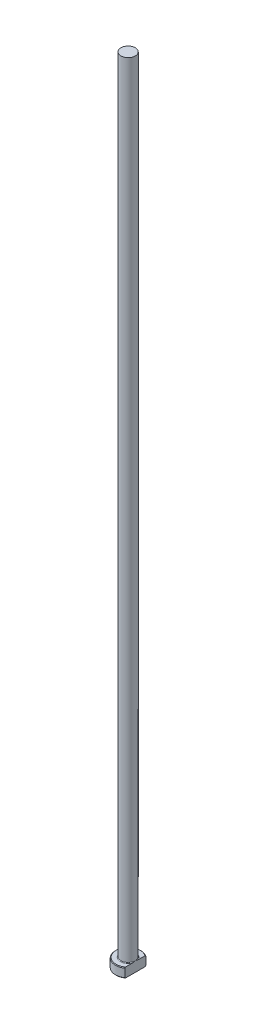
ISO-10303-21;
HEADER;
FILE_DESCRIPTION(('STEP AP214'),'2;1');
FILE_NAME('part.step','',(''),(''),'','','');
FILE_SCHEMA(('AUTOMOTIVE_DESIGN { 1 0 10303 214 1 1 1 1 }'));
ENDSEC;
DATA;
#1=APPLICATION_CONTEXT('core data for automotive mechanical design processes');
#2=APPLICATION_PROTOCOL_DEFINITION('international standard','automotive_design',2000,#1);
#3=PRODUCT_CONTEXT('',#1,'mechanical');
#4=PRODUCT('Part','Part','',(#3));
#5=PRODUCT_RELATED_PRODUCT_CATEGORY('part','',(#4));
#6=PRODUCT_DEFINITION_FORMATION('','',#4);
#7=PRODUCT_DEFINITION_CONTEXT('part definition',#1,'design');
#8=PRODUCT_DEFINITION('design','',#6,#7);
#9=PRODUCT_DEFINITION_SHAPE('','',#8);
#10=(LENGTH_UNIT() NAMED_UNIT(*) SI_UNIT(.MILLI.,.METRE.));
#11=(NAMED_UNIT(*) PLANE_ANGLE_UNIT() SI_UNIT($,.RADIAN.));
#12=(NAMED_UNIT(*) SI_UNIT($,.STERADIAN.) SOLID_ANGLE_UNIT());
#13=UNCERTAINTY_MEASURE_WITH_UNIT(LENGTH_MEASURE(1.E-05),#10,'distance_accuracy_value','');
#14=(GEOMETRIC_REPRESENTATION_CONTEXT(3) GLOBAL_UNCERTAINTY_ASSIGNED_CONTEXT((#13)) GLOBAL_UNIT_ASSIGNED_CONTEXT((#10,
#11,#12)) REPRESENTATION_CONTEXT('',''));
#15=CARTESIAN_POINT('',(0.,0.,0.));
#16=DIRECTION('',(0.,0.,1.));
#17=DIRECTION('',(1.,0.,0.));
#18=AXIS2_PLACEMENT_3D('',#15,#16,#17);
#19=CARTESIAN_POINT('',(0.,0.,0.));
#20=DIRECTION('',(0.,-1.,0.));
#21=DIRECTION('',(0.,0.,-1.));
#22=AXIS2_PLACEMENT_3D('',#19,#20,#21);
#23=PLANE('',#22);
#24=CARTESIAN_POINT('',(0.,0.,0.));
#25=DIRECTION('',(0.,-1.,0.));
#26=DIRECTION('',(0.,0.,-1.));
#27=AXIS2_PLACEMENT_3D('',#24,#25,#26);
#28=CIRCLE('',#27,3.79999999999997);
#29=CARTESIAN_POINT('',(2.24999999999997,0.,3.0622703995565));
#30=VERTEX_POINT('',#29);
#31=CARTESIAN_POINT('',(2.24999999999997,0.,-3.0622703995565));
#32=VERTEX_POINT('',#31);
#33=EDGE_CURVE('E98',#30,#32,#28,.T.);
#34=ORIENTED_EDGE('',*,*,#33,.T.);
#35=DIRECTION('',(0.,0.,1.));
#36=VECTOR('',#35,1.);
#37=CARTESIAN_POINT('',(2.24999999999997,0.,-3.30718913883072));
#38=LINE('',#37,#36);
#39=EDGE_CURVE('E83',#32,#30,#38,.T.);
#40=ORIENTED_EDGE('',*,*,#39,.T.);
#41=EDGE_LOOP('',(#34,#40));
#42=FACE_BOUND('',#41,.T.);
#43=ADVANCED_FACE('F32',(#42),#23,.T.);
#44=CARTESIAN_POINT('',(0.,259.958771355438,0.));
#45=DIRECTION('',(0.,1.,0.));
#46=DIRECTION('',(0.,0.,1.));
#47=AXIS2_PLACEMENT_3D('',#44,#45,#46);
#48=CYLINDRICAL_SURFACE('',#47,3.99999999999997);
#49=CARTESIAN_POINT('',(0.,2.80000000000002,0.));
#50=DIRECTION('',(0.,1.,0.));
#51=DIRECTION('',(0.,0.,1.));
#52=AXIS2_PLACEMENT_3D('',#49,#50,#51);
#53=CIRCLE('',#52,3.99999999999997);
#54=CARTESIAN_POINT('',(2.24999999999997,2.80000000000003,3.30718913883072));
#55=VERTEX_POINT('',#54);
#56=CARTESIAN_POINT('',(2.24999999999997,2.80000000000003,-3.30718913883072));
#57=VERTEX_POINT('',#56);
#58=EDGE_CURVE('E104',#55,#57,#53,.F.);
#59=ORIENTED_EDGE('',*,*,#58,.T.);
#60=DIRECTION('',(0.,-1.,0.));
#61=VECTOR('',#60,1.);
#62=CARTESIAN_POINT('',(2.24999999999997,250.,-3.30718913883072));
#63=LINE('',#62,#61);
#64=CARTESIAN_POINT('',(2.24999999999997,0.200000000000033,-3.30718913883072));
#65=VERTEX_POINT('',#64);
#66=EDGE_CURVE('E183',#57,#65,#63,.T.);
#67=ORIENTED_EDGE('',*,*,#66,.T.);
#68=CARTESIAN_POINT('',(0.,0.200000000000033,0.));
#69=DIRECTION('',(0.,-1.,0.));
#70=DIRECTION('',(0.,0.,-1.));
#71=AXIS2_PLACEMENT_3D('',#68,#69,#70);
#72=CIRCLE('',#71,3.99999999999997);
#73=CARTESIAN_POINT('',(2.24999999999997,0.200000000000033,3.30718913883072));
#74=VERTEX_POINT('',#73);
#75=EDGE_CURVE('E100',#65,#74,#72,.F.);
#76=ORIENTED_EDGE('',*,*,#75,.T.);
#77=DIRECTION('',(0.,-1.,0.));
#78=VECTOR('',#77,1.);
#79=CARTESIAN_POINT('',(2.24999999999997,250.,3.30718913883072));
#80=LINE('',#79,#78);
#81=EDGE_CURVE('E93',#55,#74,#80,.T.);
#82=ORIENTED_EDGE('',*,*,#81,.F.);
#83=EDGE_LOOP('',(#59,#67,#76,#82));
#84=FACE_BOUND('',#83,.T.);
#85=ADVANCED_FACE('F158',(#84),#48,.T.);
#86=CARTESIAN_POINT('',(-3.99999999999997,3.,0.));
#87=DIRECTION('',(0.,1.,0.));
#88=DIRECTION('',(0.,0.,1.));
#89=AXIS2_PLACEMENT_3D('',#86,#87,#88);
#90=PLANE('',#89);
#91=CARTESIAN_POINT('',(0.,3.,0.));
#92=DIRECTION('',(0.,1.,0.));
#93=DIRECTION('',(0.,0.,1.));
#94=AXIS2_PLACEMENT_3D('',#91,#92,#93);
#95=CIRCLE('',#94,3.8);
#96=CARTESIAN_POINT('',(2.24999999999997,3.,-3.06227039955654));
#97=VERTEX_POINT('',#96);
#98=CARTESIAN_POINT('',(2.24999999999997,3.,3.06227039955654));
#99=VERTEX_POINT('',#98);
#100=EDGE_CURVE('E178',#97,#99,#95,.T.);
#101=ORIENTED_EDGE('',*,*,#100,.T.);
#102=DIRECTION('',(0.,0.,-1.));
#103=VECTOR('',#102,1.);
#104=CARTESIAN_POINT('',(2.24999999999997,3.,0.));
#105=LINE('',#104,#103);
#106=CARTESIAN_POINT('',(2.24999999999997,2.99999999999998,0.969535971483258));
#107=VERTEX_POINT('',#106);
#108=EDGE_CURVE('E57',#99,#107,#105,.T.);
#109=ORIENTED_EDGE('',*,*,#108,.T.);
#110=CARTESIAN_POINT('',(0.,3.,0.));
#111=DIRECTION('',(0.,1.,0.));
#112=DIRECTION('',(0.,0.,1.));
#113=AXIS2_PLACEMENT_3D('',#110,#111,#112);
#114=CIRCLE('',#113,2.44999999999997);
#115=CARTESIAN_POINT('',(2.24999999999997,2.99999999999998,-0.969535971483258));
#116=VERTEX_POINT('',#115);
#117=EDGE_CURVE('E107',#107,#116,#114,.F.);
#118=ORIENTED_EDGE('',*,*,#117,.T.);
#119=EDGE_CURVE('E136',#116,#97,#105,.T.);
#120=ORIENTED_EDGE('',*,*,#119,.T.);
#121=EDGE_LOOP('',(#101,#109,#118,#120));
#122=FACE_BOUND('',#121,.T.);
#123=ADVANCED_FACE('F147',(#122),#90,.T.);
#124=CARTESIAN_POINT('',(0.,3.,0.));
#125=DIRECTION('',(0.,-1.,0.));
#126=DIRECTION('',(0.,0.,-1.));
#127=AXIS2_PLACEMENT_3D('',#124,#125,#126);
#128=CONICAL_SURFACE('',#127,3.8,0.785398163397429);
#129=ORIENTED_EDGE('',*,*,#58,.F.);
#130=CARTESIAN_POINT('',(2.24999999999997,-0.817697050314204,7.27782992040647));
#131=CARTESIAN_POINT('',(2.24999999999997,-0.691332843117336,7.14556140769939));
#132=CARTESIAN_POINT('',(2.24999999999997,-0.565122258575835,7.01314597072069));
#133=CARTESIAN_POINT('',(2.24999999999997,-0.313071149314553,6.74796170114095));
#134=CARTESIAN_POINT('',(2.24999999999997,-0.187230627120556,6.61519286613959));
#135=CARTESIAN_POINT('',(2.24999999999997,0.189705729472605,6.21619905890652));
#136=CARTESIAN_POINT('',(2.24999999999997,0.44014920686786,5.94935693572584));
#137=CARTESIAN_POINT('',(2.24999999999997,0.940260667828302,5.41146981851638));
#138=CARTESIAN_POINT('',(2.24999999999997,1.18991116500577,5.14040850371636));
#139=CARTESIAN_POINT('',(2.24999999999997,1.56140055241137,4.7311368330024));
#140=CARTESIAN_POINT('',(2.24999999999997,1.68472451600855,4.59427552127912));
#141=CARTESIAN_POINT('',(2.24999999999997,1.93009407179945,4.31941326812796));
#142=CARTESIAN_POINT('',(2.24999999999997,2.05213967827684,4.18141233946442));
#143=CARTESIAN_POINT('',(2.24999999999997,2.31419582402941,3.88150807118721));
#144=CARTESIAN_POINT('',(2.24999999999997,2.45391708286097,3.71935099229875));
#145=CARTESIAN_POINT('',(2.24999999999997,2.73025215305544,3.39234412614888));
#146=CARTESIAN_POINT('',(2.24999999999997,2.86686529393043,3.22749377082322));
#147=CARTESIAN_POINT('',(2.24999999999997,3.13534139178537,2.8943084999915));
#148=CARTESIAN_POINT('',(2.24999999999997,3.26721073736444,2.72597879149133));
#149=CARTESIAN_POINT('',(2.24999999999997,3.45966785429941,2.46950762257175));
#150=CARTESIAN_POINT('',(2.24999999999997,3.52291962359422,2.3833682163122));
#151=CARTESIAN_POINT('',(2.24999999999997,3.64714184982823,2.20946418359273));
#152=CARTESIAN_POINT('',(2.24999999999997,3.70811252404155,2.12169971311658));
#153=CARTESIAN_POINT('',(2.24999999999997,3.82102230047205,1.95327886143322));
#154=CARTESIAN_POINT('',(2.24999999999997,3.87324695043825,1.87281476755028));
#155=CARTESIAN_POINT('',(2.24999999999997,3.97467249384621,1.70998172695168));
#156=CARTESIAN_POINT('',(2.24999999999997,4.02387305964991,1.62761257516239));
#157=CARTESIAN_POINT('',(2.24999999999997,4.11837607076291,1.46059799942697));
#158=CARTESIAN_POINT('',(2.24999999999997,4.16367708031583,1.3759517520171));
#159=CARTESIAN_POINT('',(2.24999999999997,4.24914050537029,1.20413766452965));
#160=CARTESIAN_POINT('',(2.24999999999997,4.28930406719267,1.11697039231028));
#161=CARTESIAN_POINT('',(2.24999999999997,4.38314726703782,0.891175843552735));
#162=CARTESIAN_POINT('',(2.24999999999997,4.4321974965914,0.750488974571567));
#163=CARTESIAN_POINT('',(2.24999999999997,4.48826674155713,0.535159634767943));
#164=CARTESIAN_POINT('',(2.24999999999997,4.50402844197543,0.462776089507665));
#165=CARTESIAN_POINT('',(2.24999999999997,4.52893388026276,0.316860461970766));
#166=CARTESIAN_POINT('',(2.24999999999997,4.53807847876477,0.243328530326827));
#167=CARTESIAN_POINT('',(2.24999999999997,4.5492247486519,0.094950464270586));
#168=CARTESIAN_POINT('',(2.24999999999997,4.55115152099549,0.0200986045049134));
#169=CARTESIAN_POINT('',(2.24999999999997,4.54752076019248,-0.129420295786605));
#170=CARTESIAN_POINT('',(2.24999999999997,4.54196316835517,-0.204087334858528));
#171=CARTESIAN_POINT('',(2.24999999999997,4.52372329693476,-0.352688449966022));
#172=CARTESIAN_POINT('',(2.24999999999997,4.51102617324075,-0.426620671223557));
#173=CARTESIAN_POINT('',(2.24999999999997,4.47926333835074,-0.573094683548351));
#174=CARTESIAN_POINT('',(2.24999999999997,4.46019612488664,-0.645636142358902));
#175=CARTESIAN_POINT('',(2.24999999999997,4.40610994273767,-0.823701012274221));
#176=CARTESIAN_POINT('',(2.24999999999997,4.3678344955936,-0.928230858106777));
#177=CARTESIAN_POINT('',(2.24999999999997,4.28232692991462,-1.13354070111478));
#178=CARTESIAN_POINT('',(2.24999999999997,4.23508812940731,-1.23431783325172));
#179=CARTESIAN_POINT('',(2.24999999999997,4.13380125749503,-1.43298762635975));
#180=CARTESIAN_POINT('',(2.24999999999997,4.07972026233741,-1.53086330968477));
#181=CARTESIAN_POINT('',(2.24999999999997,3.99496203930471,-1.67548648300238));
#182=CARTESIAN_POINT('',(2.24999999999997,3.96610811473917,-1.72332162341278));
#183=CARTESIAN_POINT('',(2.24999999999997,3.90734436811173,-1.81833709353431));
#184=CARTESIAN_POINT('',(2.24999999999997,3.87743458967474,-1.8655174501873));
#185=CARTESIAN_POINT('',(2.24999999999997,3.77509597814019,-2.02354622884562));
#186=CARTESIAN_POINT('',(2.24999999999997,3.70057106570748,-2.13303820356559));
#187=CARTESIAN_POINT('',(2.24999999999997,3.54784662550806,-2.34943854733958));
#188=CARTESIAN_POINT('',(2.24999999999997,3.46964624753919,-2.45634630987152));
#189=CARTESIAN_POINT('',(2.24999999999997,3.31046802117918,-2.66818697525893));
#190=CARTESIAN_POINT('',(2.24999999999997,3.22948822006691,-2.77311840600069));
#191=CARTESIAN_POINT('',(2.24999999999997,3.06545223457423,-2.98134898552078));
#192=CARTESIAN_POINT('',(2.24999999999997,2.98239592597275,-3.08464803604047));
#193=CARTESIAN_POINT('',(2.24999999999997,2.73044258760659,-3.39308007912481));
#194=CARTESIAN_POINT('',(2.24999999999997,2.55914389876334,-3.59624854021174));
#195=CARTESIAN_POINT('',(2.24999999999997,2.21260420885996,-3.9990152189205));
#196=CARTESIAN_POINT('',(2.24999999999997,2.03736490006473,-4.19861490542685));
#197=CARTESIAN_POINT('',(2.24999999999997,1.68403823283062,-4.59551245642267));
#198=CARTESIAN_POINT('',(2.24999999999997,1.50594904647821,-4.79280869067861));
#199=CARTESIAN_POINT('',(2.24999999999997,1.14782580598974,-5.18566037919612));
#200=CARTESIAN_POINT('',(2.24999999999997,0.967791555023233,-5.38121565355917));
#201=CARTESIAN_POINT('',(2.24999999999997,0.606519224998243,-5.77078870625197));
#202=CARTESIAN_POINT('',(2.24999999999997,0.425282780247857,-5.96480800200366));
#203=CARTESIAN_POINT('',(2.24999999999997,0.0617463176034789,-6.35184762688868));
#204=CARTESIAN_POINT('',(2.24999999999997,-0.120553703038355,-6.54486795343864));
#205=CARTESIAN_POINT('',(2.24999999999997,-0.388876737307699,-6.82775668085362));
#206=CARTESIAN_POINT('',(2.24999999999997,-0.474578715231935,-6.91792994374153));
#207=CARTESIAN_POINT('',(2.24999999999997,-0.646062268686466,-7.09803491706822));
#208=CARTESIAN_POINT('',(2.24999999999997,-0.731843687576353,-7.18796677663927));
#209=CARTESIAN_POINT('',(2.24999999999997,-0.817697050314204,-7.27782992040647));
#210=B_SPLINE_CURVE_WITH_KNOTS('',3,(#130,#131,#132,#133,#134,#135,#136,#137,#138,#139,#140,
#141,#142,#143,#144,#145,#146,#147,#148,#149,#150,#151,#152,#153,#154,#155,#156,#157,#158,#159,
#160,#161,#162,#163,#164,#165,#166,#167,#168,#169,#170,#171,#172,#173,#174,#175,#176,#177,#178,
#179,#180,#181,#182,#183,#184,#185,#186,#187,#188,#189,#190,#191,#192,#193,#194,#195,#196,#197,
#198,#199,#200,#201,#202,#203,#204,#205,#206,#207,#208,#209),.UNSPECIFIED.,.F.,.F.,(4,2,2,2,2,2,
2,2,2,2,2,2,2,2,2,2,2,2,2,2,2,2,2,2,2,2,2,2,2,2,2,2,2,2,2,2,2,2,2,4),(0.,0.548785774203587,
1.09757528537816,2.19544562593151,3.30094607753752,3.85362276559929,4.40629327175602,
5.04841012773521,5.69066421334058,6.33201824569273,6.65259523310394,6.97314160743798,
7.26086761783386,7.54862474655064,7.83648737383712,8.12428565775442,8.56956070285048,
8.79154735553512,9.01350513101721,9.23775987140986,9.46201637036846,9.68674086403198,
9.91151839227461,10.2448678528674,10.5784668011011,10.9137368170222,11.0813178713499,
11.2488920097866,11.6461164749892,12.0434332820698,12.4410351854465,12.8386609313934,
13.6357991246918,14.43260129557,15.2299368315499,16.0273538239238,16.8238479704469,
17.6203441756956,17.9935523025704,18.3664002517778),.UNSPECIFIED.);
#211=EDGE_CURVE('E135',#55,#99,#210,.T.);
#212=ORIENTED_EDGE('',*,*,#211,.T.);
#213=ORIENTED_EDGE('',*,*,#100,.F.);
#214=EDGE_CURVE('E127',#97,#57,#210,.T.);
#215=ORIENTED_EDGE('',*,*,#214,.T.);
#216=EDGE_LOOP('',(#129,#212,#213,#215));
#217=FACE_BOUND('',#216,.T.);
#218=ADVANCED_FACE('F143',(#217),#128,.T.);
#219=CARTESIAN_POINT('',(0.,0.200000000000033,0.));
#220=DIRECTION('',(0.,1.,0.));
#221=DIRECTION('',(0.,0.,1.));
#222=AXIS2_PLACEMENT_3D('',#219,#220,#221);
#223=CONICAL_SURFACE('',#222,3.99999999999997,0.785398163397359);
#224=ORIENTED_EDGE('',*,*,#75,.F.);
#225=CARTESIAN_POINT('',(2.24999999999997,3.81769705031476,-7.27782992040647));
#226=CARTESIAN_POINT('',(2.24999999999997,3.69133284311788,-7.14556140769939));
#227=CARTESIAN_POINT('',(2.24999999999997,3.56512225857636,-7.01314597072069));
#228=CARTESIAN_POINT('',(2.24999999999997,3.31307114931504,-6.74796170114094));
#229=CARTESIAN_POINT('',(2.24999999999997,3.18723062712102,-6.61519286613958));
#230=CARTESIAN_POINT('',(2.24999999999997,2.8102942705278,-6.21619905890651));
#231=CARTESIAN_POINT('',(2.24999999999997,2.55985079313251,-5.94935693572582));
#232=CARTESIAN_POINT('',(2.24999999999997,2.05973933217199,-5.41146981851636));
#233=CARTESIAN_POINT('',(2.24999999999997,1.81008883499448,-5.14040850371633));
#234=CARTESIAN_POINT('',(2.24999999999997,1.43859944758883,-4.73113683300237));
#235=CARTESIAN_POINT('',(2.24999999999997,1.31527548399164,-4.59427552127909));
#236=CARTESIAN_POINT('',(2.24999999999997,1.0699059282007,-4.31941326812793));
#237=CARTESIAN_POINT('',(2.24999999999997,0.94786032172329,-4.18141233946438));
#238=CARTESIAN_POINT('',(2.24999999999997,0.685804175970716,-3.88150807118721));
#239=CARTESIAN_POINT('',(2.24999999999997,0.546082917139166,-3.71935099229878));
#240=CARTESIAN_POINT('',(2.24999999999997,0.269747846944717,-3.39234412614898));
#241=CARTESIAN_POINT('',(2.24999999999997,0.133134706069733,-3.22749377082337));
#242=CARTESIAN_POINT('',(2.24999999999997,-0.135341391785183,-2.89430849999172));
#243=CARTESIAN_POINT('',(2.24999999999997,-0.267210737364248,-2.72597879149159));
#244=CARTESIAN_POINT('',(2.24999999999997,-0.459667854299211,-2.46950762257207));
#245=CARTESIAN_POINT('',(2.24999999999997,-0.522919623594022,-2.38336821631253));
#246=CARTESIAN_POINT('',(2.24999999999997,-0.647141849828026,-2.20946418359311));
#247=CARTESIAN_POINT('',(2.24999999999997,-0.708112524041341,-2.12169971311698));
#248=CARTESIAN_POINT('',(2.24999999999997,-0.821022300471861,-1.95327886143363));
#249=CARTESIAN_POINT('',(2.24999999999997,-0.873246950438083,-1.87281476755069));
#250=CARTESIAN_POINT('',(2.24999999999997,-0.974672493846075,-1.70998172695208));
#251=CARTESIAN_POINT('',(2.24999999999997,-1.02387305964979,-1.62761257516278));
#252=CARTESIAN_POINT('',(2.24999999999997,-1.11837607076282,-1.46059799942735));
#253=CARTESIAN_POINT('',(2.24999999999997,-1.16367708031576,-1.37595175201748));
#254=CARTESIAN_POINT('',(2.24999999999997,-1.24914050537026,-1.20413766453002));
#255=CARTESIAN_POINT('',(2.24999999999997,-1.28930406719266,-1.11697039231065));
#256=CARTESIAN_POINT('',(2.24999999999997,-1.38314726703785,-0.891175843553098));
#257=CARTESIAN_POINT('',(2.24999999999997,-1.43219749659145,-0.750488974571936));
#258=CARTESIAN_POINT('',(2.24999999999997,-1.48826674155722,-0.535159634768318));
#259=CARTESIAN_POINT('',(2.24999999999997,-1.50402844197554,-0.462776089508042));
#260=CARTESIAN_POINT('',(2.24999999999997,-1.52893388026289,-0.316860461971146));
#261=CARTESIAN_POINT('',(2.24999999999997,-1.53807847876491,-0.243328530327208));
#262=CARTESIAN_POINT('',(2.24999999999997,-1.54922474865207,-0.0949504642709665));
#263=CARTESIAN_POINT('',(2.24999999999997,-1.55115152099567,-0.0200986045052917));
#264=CARTESIAN_POINT('',(2.24999999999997,-1.54752076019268,0.129420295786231));
#265=CARTESIAN_POINT('',(2.24999999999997,-1.54196316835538,0.204087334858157));
#266=CARTESIAN_POINT('',(2.24999999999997,-1.523723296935,0.352688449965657));
#267=CARTESIAN_POINT('',(2.24999999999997,-1.511026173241,0.426620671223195));
#268=CARTESIAN_POINT('',(2.24999999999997,-1.47926333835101,0.573094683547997));
#269=CARTESIAN_POINT('',(2.24999999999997,-1.46019612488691,0.645636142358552));
#270=CARTESIAN_POINT('',(2.24999999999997,-1.40610994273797,0.823701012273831));
#271=CARTESIAN_POINT('',(2.24999999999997,-1.36783449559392,0.928230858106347));
#272=CARTESIAN_POINT('',(2.24999999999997,-1.282326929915,1.13354070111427));
#273=CARTESIAN_POINT('',(2.24999999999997,-1.23508812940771,1.23431783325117));
#274=CARTESIAN_POINT('',(2.24999999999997,-1.13380125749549,1.43298762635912));
#275=CARTESIAN_POINT('',(2.24999999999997,-1.0797202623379,1.53086330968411));
#276=CARTESIAN_POINT('',(2.24999999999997,-0.994962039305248,1.67548648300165));
#277=CARTESIAN_POINT('',(2.24999999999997,-0.966108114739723,1.72332162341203));
#278=CARTESIAN_POINT('',(2.24999999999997,-0.907344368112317,1.81833709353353));
#279=CARTESIAN_POINT('',(2.24999999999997,-0.877434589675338,1.86551745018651));
#280=CARTESIAN_POINT('',(2.24999999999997,-0.775095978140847,2.02354622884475));
#281=CARTESIAN_POINT('',(2.24999999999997,-0.700571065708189,2.13303820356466));
#282=CARTESIAN_POINT('',(2.24999999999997,-0.547846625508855,2.34943854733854));
#283=CARTESIAN_POINT('',(2.24999999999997,-0.469646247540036,2.45634630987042));
#284=CARTESIAN_POINT('',(2.24999999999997,-0.310468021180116,2.66818697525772));
#285=CARTESIAN_POINT('',(2.24999999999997,-0.229488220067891,2.77311840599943));
#286=CARTESIAN_POINT('',(2.24999999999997,-0.065452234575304,2.98134898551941));
#287=CARTESIAN_POINT('',(2.24999999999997,0.0176040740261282,3.08464803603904));
#288=CARTESIAN_POINT('',(2.24999999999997,0.269557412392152,3.39308007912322));
#289=CARTESIAN_POINT('',(2.24999999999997,0.440856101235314,3.59624854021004));
#290=CARTESIAN_POINT('',(2.24999999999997,0.787395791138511,3.99901521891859));
#291=CARTESIAN_POINT('',(2.24999999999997,0.962635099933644,4.19861490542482));
#292=CARTESIAN_POINT('',(2.24999999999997,1.31596176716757,4.59551245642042));
#293=CARTESIAN_POINT('',(2.24999999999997,1.49405095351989,4.79280869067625));
#294=CARTESIAN_POINT('',(2.24999999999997,1.85217419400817,5.18566037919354));
#295=CARTESIAN_POINT('',(2.24999999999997,2.0322084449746,5.38121565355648));
#296=CARTESIAN_POINT('',(2.24999999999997,2.39348077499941,5.77078870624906));
#297=CARTESIAN_POINT('',(2.24999999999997,2.5747172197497,5.96480800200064));
#298=CARTESIAN_POINT('',(2.24999999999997,2.9382536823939,6.35184762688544));
#299=CARTESIAN_POINT('',(2.24999999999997,3.12055370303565,6.54486795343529));
#300=CARTESIAN_POINT('',(2.24999999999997,3.38887673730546,6.82775668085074));
#301=CARTESIAN_POINT('',(2.24999999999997,3.47457871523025,6.91792994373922));
#302=CARTESIAN_POINT('',(2.24999999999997,3.6460622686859,7.09803491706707));
#303=CARTESIAN_POINT('',(2.24999999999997,3.73184368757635,7.1879667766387));
#304=CARTESIAN_POINT('',(2.24999999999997,3.81769705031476,7.27782992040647));
#305=B_SPLINE_CURVE_WITH_KNOTS('',3,(#225,#226,#227,#228,#229,#230,#231,#232,#233,#234,#235,
#236,#237,#238,#239,#240,#241,#242,#243,#244,#245,#246,#247,#248,#249,#250,#251,#252,#253,#254,
#255,#256,#257,#258,#259,#260,#261,#262,#263,#264,#265,#266,#267,#268,#269,#270,#271,#272,#273,
#274,#275,#276,#277,#278,#279,#280,#281,#282,#283,#284,#285,#286,#287,#288,#289,#290,#291,#292,
#293,#294,#295,#296,#297,#298,#299,#300,#301,#302,#303,#304),.UNSPECIFIED.,.F.,.F.,(4,2,2,2,2,2,
2,2,2,2,2,2,2,2,2,2,2,2,2,2,2,2,2,2,2,2,2,2,2,2,2,2,2,2,2,2,2,2,2,4),(0.,0.548785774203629,
1.09757528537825,2.19544562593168,3.30094607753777,3.85362276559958,4.40629327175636,
5.04841012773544,5.69066421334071,6.33201824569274,6.65259523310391,6.97314160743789,
7.26086761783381,7.54862474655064,7.83648737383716,8.12428565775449,8.56956070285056,
8.7915473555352,9.01350513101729,9.23775987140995,9.46201637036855,9.68674086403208,
9.91151839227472,10.2448678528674,10.5784668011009,10.9137368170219,11.0813178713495,
11.2488920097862,11.6461164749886,12.0434332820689,12.4410351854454,12.838660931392,
13.63579912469,14.4326012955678,15.2299368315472,16.0273538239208,16.8238479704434,
17.6203441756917,17.9935523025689,18.3664002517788),.UNSPECIFIED.);
#306=EDGE_CURVE('E86',#65,#32,#305,.T.);
#307=ORIENTED_EDGE('',*,*,#306,.T.);
#308=ORIENTED_EDGE('',*,*,#33,.F.);
#309=EDGE_CURVE('E89',#30,#74,#305,.T.);
#310=ORIENTED_EDGE('',*,*,#309,.T.);
#311=EDGE_LOOP('',(#224,#307,#308,#310));
#312=FACE_BOUND('',#311,.T.);
#313=ADVANCED_FACE('F97',(#312),#223,.T.);
#314=CARTESIAN_POINT('',(0.,3.19999999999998,0.));
#315=DIRECTION('',(0.,1.,0.));
#316=DIRECTION('',(0.,0.,1.));
#317=AXIS2_PLACEMENT_3D('',#314,#315,#316);
#318=TOROIDAL_SURFACE('',#317,2.44999999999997,0.2);
#319=CARTESIAN_POINT('',(2.24999999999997,3.19999999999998,0.));
#320=CARTESIAN_POINT('',(2.24999999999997,3.20000050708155,6.44726104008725E-11));
#321=CARTESIAN_POINT('',(2.24999999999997,3.20000101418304,-1.58891186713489E-07));
#322=CARTESIAN_POINT('',(2.24999999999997,3.20000197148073,-6.21779236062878E-07));
#323=CARTESIAN_POINT('',(2.24999999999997,3.20000241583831,-9.34460755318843E-07));
#324=CARTESIAN_POINT('',(2.24999999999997,3.20000332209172,-1.68105190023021E-06));
#325=CARTESIAN_POINT('',(2.24999999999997,3.20000377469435,-2.12646372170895E-06));
#326=CARTESIAN_POINT('',(2.24999999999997,3.20000460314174,-3.06333876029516E-06));
#327=CARTESIAN_POINT('',(2.24999999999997,3.2000049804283,-3.55360517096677E-06));
#328=CARTESIAN_POINT('',(2.24999999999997,3.20000633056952,-5.39956008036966E-06));
#329=CARTESIAN_POINT('',(2.24999999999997,3.20000722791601,-6.81237619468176E-06));
#330=CARTESIAN_POINT('',(2.24999999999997,3.20000875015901,-9.65315882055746E-06));
#331=CARTESIAN_POINT('',(2.24999999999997,3.2000093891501,-1.10739426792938E-05));
#332=CARTESIAN_POINT('',(2.24999999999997,3.20001197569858,-1.69289386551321E-05));
#333=CARTESIAN_POINT('',(2.24999999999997,3.20001384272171,-2.14029807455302E-05));
#334=CARTESIAN_POINT('',(2.24999999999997,3.20001668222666,-2.99701699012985E-05));
#335=CARTESIAN_POINT('',(2.24999999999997,3.20001774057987,-3.40349906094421E-05));
#336=CARTESIAN_POINT('',(2.24999999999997,3.20002529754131,-6.37611258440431E-05));
#337=CARTESIAN_POINT('',(2.24999999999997,3.20003087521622,-8.96095284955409E-05));
#338=CARTESIAN_POINT('',(2.24999999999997,3.20005527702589,-0.00019117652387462));
#339=CARTESIAN_POINT('',(2.24999999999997,3.20007870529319,-0.000265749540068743));
#340=CARTESIAN_POINT('',(2.24999999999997,3.2001693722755,-0.000559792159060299));
#341=CARTESIAN_POINT('',(2.24999999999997,3.20023350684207,-0.000779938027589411));
#342=CARTESIAN_POINT('',(2.24999999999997,3.20048920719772,-0.00165050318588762));
#343=CARTESIAN_POINT('',(2.24999999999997,3.20068459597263,-0.00230007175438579));
#344=CARTESIAN_POINT('',(2.24999999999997,3.20149322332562,-0.00499620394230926));
#345=CARTESIAN_POINT('',(2.24999999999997,3.20210170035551,-0.00704382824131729));
#346=CARTESIAN_POINT('',(2.24999999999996,3.2079710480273,-0.0267853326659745));
#347=CARTESIAN_POINT('',(2.24999999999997,3.21325284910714,-0.0444747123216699));
#348=CARTESIAN_POINT('',(2.24999999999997,3.22356918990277,-0.0791736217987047));
#349=CARTESIAN_POINT('',(2.24999999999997,3.22860532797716,-0.0961827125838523));
#350=CARTESIAN_POINT('',(2.24999999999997,3.23925368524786,-0.132326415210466));
#351=CARTESIAN_POINT('',(2.24999999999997,3.24485983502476,-0.151462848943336));
#352=CARTESIAN_POINT('',(2.24999999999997,3.25603662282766,-0.189968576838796));
#353=CARTESIAN_POINT('',(2.24999999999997,3.26160623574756,-0.209338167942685));
#354=CARTESIAN_POINT('',(2.24999999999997,3.27500311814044,-0.256523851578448));
#355=CARTESIAN_POINT('',(2.24999999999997,3.28276182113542,-0.284359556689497));
#356=CARTESIAN_POINT('',(2.24999999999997,3.29771346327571,-0.339425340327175));
#357=CARTESIAN_POINT('',(2.24999999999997,3.30491576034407,-0.36665287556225));
#358=CARTESIAN_POINT('',(2.24999999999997,3.32240345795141,-0.435090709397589));
#359=CARTESIAN_POINT('',(2.24999999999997,3.33239618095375,-0.476377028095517));
#360=CARTESIAN_POINT('',(2.24999999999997,3.35100390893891,-0.559624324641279));
#361=CARTESIAN_POINT('',(2.24999999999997,3.3596067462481,-0.601588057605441));
#362=CARTESIAN_POINT('',(2.24999999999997,3.37543235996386,-0.689258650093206));
#363=CARTESIAN_POINT('',(2.24999999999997,3.38248971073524,-0.73499643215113));
#364=CARTESIAN_POINT('',(2.24999999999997,3.39342529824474,-0.826730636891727));
#365=CARTESIAN_POINT('',(2.24999999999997,3.39731270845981,-0.872725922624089));
#366=CARTESIAN_POINT('',(2.24999999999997,3.40071499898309,-0.963783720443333));
#367=CARTESIAN_POINT('',(2.24999999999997,3.40033773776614,-1.00884048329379));
#368=CARTESIAN_POINT('',(2.24999999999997,3.39535803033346,-1.07577565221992));
#369=CARTESIAN_POINT('',(2.24999999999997,3.39299580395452,-1.09781842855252));
#370=CARTESIAN_POINT('',(2.24999999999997,3.38649339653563,-1.14163100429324));
#371=CARTESIAN_POINT('',(2.24999999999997,3.38235512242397,-1.16340107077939));
#372=CARTESIAN_POINT('',(2.24999999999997,3.37178290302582,-1.20664751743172));
#373=CARTESIAN_POINT('',(2.24999999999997,3.36532376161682,-1.2281178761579));
#374=CARTESIAN_POINT('',(2.24999999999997,3.34940253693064,-1.26994619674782));
#375=CARTESIAN_POINT('',(2.24999999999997,3.33994859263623,-1.29030700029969));
#376=CARTESIAN_POINT('',(2.24999999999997,3.32341167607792,-1.3178414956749));
#377=CARTESIAN_POINT('',(2.24999999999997,3.31797729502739,-1.32600125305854));
#378=CARTESIAN_POINT('',(2.24999999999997,3.30618383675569,-1.34165219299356));
#379=CARTESIAN_POINT('',(2.24999999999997,3.29982370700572,-1.34914259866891));
#380=CARTESIAN_POINT('',(2.24999999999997,3.28597385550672,-1.36322511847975));
#381=CARTESIAN_POINT('',(2.24999999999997,3.27846961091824,-1.36980324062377));
#382=CARTESIAN_POINT('',(2.24999999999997,3.26235014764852,-1.3814177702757));
#383=CARTESIAN_POINT('',(2.24999999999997,3.25373945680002,-1.38646019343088));
#384=CARTESIAN_POINT('',(2.24999999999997,3.23893119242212,-1.39291408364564));
#385=CARTESIAN_POINT('',(2.24999999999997,3.23301804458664,-1.39497873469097));
#386=CARTESIAN_POINT('',(2.24999999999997,3.22092968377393,-1.3980973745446));
#387=CARTESIAN_POINT('',(2.24999999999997,3.21475469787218,-1.39915222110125));
#388=CARTESIAN_POINT('',(2.24999999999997,3.20229305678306,-1.4001597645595));
#389=CARTESIAN_POINT('',(2.24999999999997,3.19600609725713,-1.40010876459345));
#390=CARTESIAN_POINT('',(2.24999999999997,3.18353929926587,-1.39890051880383));
#391=CARTESIAN_POINT('',(2.24999999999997,3.17735949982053,-1.39774287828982));
#392=CARTESIAN_POINT('',(2.24999999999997,3.16550896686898,-1.39448677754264));
#393=CARTESIAN_POINT('',(2.24999999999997,3.15982782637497,-1.39242539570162));
#394=CARTESIAN_POINT('',(2.24999999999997,3.14882191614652,-1.38751374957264));
#395=CARTESIAN_POINT('',(2.24999999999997,3.14349727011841,-1.38466321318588));
#396=CARTESIAN_POINT('',(2.24999999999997,3.13026923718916,-1.37647479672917));
#397=CARTESIAN_POINT('',(2.24999999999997,3.12266499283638,-1.37065399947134));
#398=CARTESIAN_POINT('',(2.24999999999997,3.10845647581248,-1.35789458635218));
#399=CARTESIAN_POINT('',(2.24999999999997,3.10185542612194,-1.3509525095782));
#400=CARTESIAN_POINT('',(2.24999999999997,3.0855320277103,-1.33150080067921));
#401=CARTESIAN_POINT('',(2.24999999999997,3.07660573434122,-1.31832816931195));
#402=CARTESIAN_POINT('',(2.24999999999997,3.06078136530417,-1.29086374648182));
#403=CARTESIAN_POINT('',(2.24999999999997,3.05388481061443,-1.27657112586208));
#404=CARTESIAN_POINT('',(2.24999999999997,3.03602738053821,-1.23377116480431));
#405=CARTESIAN_POINT('',(2.24999999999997,3.02722778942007,-1.20437236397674));
#406=CARTESIAN_POINT('',(2.24999999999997,3.01362163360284,-1.14441037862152));
#407=CARTESIAN_POINT('',(2.24999999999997,3.00886464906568,-1.11383741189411));
#408=CARTESIAN_POINT('',(2.24999999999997,3.00105881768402,-1.03966563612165));
#409=CARTESIAN_POINT('',(2.24999999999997,2.99953171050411,-0.995912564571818));
#410=CARTESIAN_POINT('',(2.24999999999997,3.00070174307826,-0.908367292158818));
#411=CARTESIAN_POINT('',(2.24999999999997,3.00341475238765,-0.86457556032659));
#412=CARTESIAN_POINT('',(2.24999999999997,3.01171554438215,-0.779778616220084));
#413=CARTESIAN_POINT('',(2.24999999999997,3.01713219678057,-0.738755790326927));
#414=CARTESIAN_POINT('',(2.24999999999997,3.03001638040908,-0.657360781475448));
#415=CARTESIAN_POINT('',(2.24999999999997,3.03746816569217,-0.616986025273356));
#416=CARTESIAN_POINT('',(2.24999999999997,3.05405724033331,-0.535981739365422));
#417=CARTESIAN_POINT('',(2.24999999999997,3.06321733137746,-0.495356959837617));
#418=CARTESIAN_POINT('',(2.24999999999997,3.0829739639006,-0.413374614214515));
#419=CARTESIAN_POINT('',(2.24999999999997,3.09360096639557,-0.372024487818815));
#420=CARTESIAN_POINT('',(2.24999999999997,3.11230155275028,-0.302306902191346));
#421=CARTESIAN_POINT('',(2.24999999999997,3.12014883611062,-0.273877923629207));
#422=CARTESIAN_POINT('',(2.24999999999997,3.13605900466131,-0.217411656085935));
#423=CARTESIAN_POINT('',(2.24999999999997,3.14411864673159,-0.189373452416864));
#424=CARTESIAN_POINT('',(2.24999999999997,3.15951571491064,-0.136466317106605));
#425=CARTESIAN_POINT('',(2.24999999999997,3.1668337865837,-0.111591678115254));
#426=CARTESIAN_POINT('',(2.24999999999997,3.18187191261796,-0.0608432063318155));
#427=CARTESIAN_POINT('',(2.24999999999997,3.18959608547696,-0.0349705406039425));
#428=CARTESIAN_POINT('',(2.24999999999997,3.19789887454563,-0.00704171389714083));
#429=CARTESIAN_POINT('',(2.24999999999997,3.19850801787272,-0.00499199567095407));
#430=CARTESIAN_POINT('',(2.24999999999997,3.19931680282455,-0.0022953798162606));
#431=CARTESIAN_POINT('',(2.24999999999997,3.19951170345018,-0.00164742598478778));
#432=CARTESIAN_POINT('',(2.24999999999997,3.19976680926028,-0.000778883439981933));
#433=CARTESIAN_POINT('',(2.24999999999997,3.19983082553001,-0.00055914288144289));
#434=CARTESIAN_POINT('',(2.24999999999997,3.19992134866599,-0.000265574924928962));
#435=CARTESIAN_POINT('',(2.24999999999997,3.19994475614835,-0.00019107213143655));
#436=CARTESIAN_POINT('',(2.24999999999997,3.19996913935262,-8.95867306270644E-05));
#437=CARTESIAN_POINT('',(2.24999999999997,3.19997471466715,-6.37485903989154E-05));
#438=CARTESIAN_POINT('',(2.24999999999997,3.1999822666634,-3.40328341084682E-05));
#439=CARTESIAN_POINT('',(2.24999999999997,3.19998332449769,-2.9968622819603E-05));
#440=CARTESIAN_POINT('',(2.24999999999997,3.19998616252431,-2.14026473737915E-05));
#441=CARTESIAN_POINT('',(2.24999999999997,3.19998802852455,-1.69291778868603E-05));
#442=CARTESIAN_POINT('',(2.24999999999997,3.19999061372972,-1.10747627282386E-05));
#443=CARTESIAN_POINT('',(2.24999999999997,3.19999125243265,-9.654024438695E-06));
#444=CARTESIAN_POINT('',(2.24999999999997,3.19999277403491,-6.81328215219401E-06));
#445=CARTESIAN_POINT('',(2.24999999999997,3.19999367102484,-5.40045583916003E-06));
#446=CARTESIAN_POINT('',(2.24999999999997,3.19999502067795,-3.55442702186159E-06));
#447=CARTESIAN_POINT('',(2.24999999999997,3.19999539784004,-3.06412583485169E-06));
#448=CARTESIAN_POINT('',(2.24999999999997,3.19999622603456,-2.12715879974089E-06));
#449=CARTESIAN_POINT('',(2.24999999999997,3.19999667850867,-1.68168917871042E-06));
#450=CARTESIAN_POINT('',(2.24999999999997,3.19999758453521,-9.34960575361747E-07));
#451=CARTESIAN_POINT('',(2.24999999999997,3.19999802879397,-6.22203836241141E-07));
#452=CARTESIAN_POINT('',(2.24999999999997,3.1999989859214,-1.59128804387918E-07));
#453=CARTESIAN_POINT('',(2.24999999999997,3.19999949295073,-6.44685022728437E-11));
#454=CARTESIAN_POINT('',(2.24999999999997,3.19999999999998,0.));
#455=B_SPLINE_CURVE_WITH_KNOTS('',3,(#319,#320,#321,#322,#323,#324,#325,#326,#327,#328,#329,
#330,#331,#332,#333,#334,#335,#336,#337,#338,#339,#340,#341,#342,#343,#344,#345,#346,#347,#348,
#349,#350,#351,#352,#353,#354,#355,#356,#357,#358,#359,#360,#361,#362,#363,#364,#365,#366,#367,
#368,#369,#370,#371,#372,#373,#374,#375,#376,#377,#378,#379,#380,#381,#382,#383,#384,#385,#386,
#387,#388,#389,#390,#391,#392,#393,#394,#395,#396,#397,#398,#399,#400,#401,#402,#403,#404,#405,
#406,#407,#408,#409,#410,#411,#412,#413,#414,#415,#416,#417,#418,#419,#420,#421,#422,#423,#424,
#425,#426,#427,#428,#429,#430,#431,#432,#433,#434,#435,#436,#437,#438,#439,#440,#441,#442,#443,
#444,#445,#446,#447,#448,#449,#450,#451,#452,#453,#454),.UNSPECIFIED.,.T.,.F.,(4,2,2,2,2,2,2,2,
2,2,2,2,2,2,2,2,2,2,2,2,2,2,2,2,2,2,2,2,2,2,2,2,2,2,2,2,2,2,2,2,2,2,2,2,2,2,2,2,2,2,2,2,2,2,2,2,
2,2,2,2,2,2,2,2,2,2,2,4),(0.,1.52660891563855E-06,3.1524133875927E-06,5.04759848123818E-06,
6.90201355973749E-06,1.19024884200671E-05,1.65722258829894E-05,3.10841862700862E-05,
4.36688554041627E-05,0.000123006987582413,0.000357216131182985,0.00104540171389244,
0.00308000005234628,0.00948876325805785,0.0648698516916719,0.118087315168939,0.17790910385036,
0.238372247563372,0.325060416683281,0.40955017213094,0.536965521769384,0.665442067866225,
0.804194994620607,0.942544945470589,1.07740386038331,1.14385780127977,1.21024056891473,
1.27736693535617,1.34431241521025,1.37367425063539,1.40306973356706,1.43287536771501,
1.46256269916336,1.48127715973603,1.49997570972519,1.51873677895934,1.53750454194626,
1.55556541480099,1.57363252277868,1.60219661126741,1.63085061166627,1.67831692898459,
1.72581872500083,1.81736829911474,1.91002510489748,2.04102939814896,2.17252517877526,
2.29658958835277,2.41972004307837,2.54462990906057,2.67269769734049,2.76117244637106,
2.84869182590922,2.92647873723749,3.00747864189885,3.01389398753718,3.01592352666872,
3.016610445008,3.0168444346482,3.01692374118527,3.01693632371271,3.01695083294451,
3.01695550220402,3.01696050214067,3.01696235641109,3.01696425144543,3.01696587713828,
3.01696740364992),.UNSPECIFIED.);
#456=CARTESIAN_POINT('',(2.24999999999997,3.19999999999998,0.));
#457=VERTEX_POINT('',#456);
#458=EDGE_CURVE('E11',#116,#457,#455,.T.);
#459=ORIENTED_EDGE('',*,*,#458,.F.);
#460=ORIENTED_EDGE('',*,*,#117,.F.);
#461=CARTESIAN_POINT('',(2.24999999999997,3.19999999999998,0.));
#462=CARTESIAN_POINT('',(2.24999999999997,3.19999949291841,-6.44726152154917E-11));
#463=CARTESIAN_POINT('',(2.24999999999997,3.19999898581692,1.58891186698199E-07));
#464=CARTESIAN_POINT('',(2.24999999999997,3.19999802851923,6.21779236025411E-07));
#465=CARTESIAN_POINT('',(2.24999999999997,3.19999758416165,9.34460755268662E-07));
#466=CARTESIAN_POINT('',(2.24999999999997,3.19999667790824,1.68105190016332E-06));
#467=CARTESIAN_POINT('',(2.24999999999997,3.19999622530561,2.12646372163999E-06));
#468=CARTESIAN_POINT('',(2.24999999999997,3.19999539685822,3.06333876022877E-06));
#469=CARTESIAN_POINT('',(2.24999999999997,3.19999501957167,3.55360517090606E-06));
#470=CARTESIAN_POINT('',(2.24999999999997,3.19999366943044,5.39956008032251E-06));
#471=CARTESIAN_POINT('',(2.24999999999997,3.19999277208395,6.81237619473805E-06));
#472=CARTESIAN_POINT('',(2.24999999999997,3.19999124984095,9.65315882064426E-06));
#473=CARTESIAN_POINT('',(2.24999999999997,3.19999061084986,1.10739426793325E-05));
#474=CARTESIAN_POINT('',(2.24999999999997,3.19998802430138,1.69289386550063E-05));
#475=CARTESIAN_POINT('',(2.24999999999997,3.19998615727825,2.14029807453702E-05));
#476=CARTESIAN_POINT('',(2.24999999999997,3.1999833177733,2.99701699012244E-05));
#477=CARTESIAN_POINT('',(2.24999999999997,3.19998225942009,3.40349906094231E-05));
#478=CARTESIAN_POINT('',(2.24999999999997,3.19997470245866,6.37611258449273E-05));
#479=CARTESIAN_POINT('',(2.24999999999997,3.19996912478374,8.96095284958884E-05));
#480=CARTESIAN_POINT('',(2.24999999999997,3.19994472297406,0.000191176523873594));
#481=CARTESIAN_POINT('',(2.24999999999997,3.19992129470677,0.00026574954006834));
#482=CARTESIAN_POINT('',(2.24999999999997,3.19983062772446,0.000559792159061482));
#483=CARTESIAN_POINT('',(2.24999999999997,3.19976649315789,0.000779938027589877));
#484=CARTESIAN_POINT('',(2.24999999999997,3.19951079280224,0.00165050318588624));
#485=CARTESIAN_POINT('',(2.24999999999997,3.19931540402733,0.00230007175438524));
#486=CARTESIAN_POINT('',(2.24999999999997,3.19850677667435,0.00499620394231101));
#487=CARTESIAN_POINT('',(2.24999999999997,3.19789829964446,0.00704382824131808));
#488=CARTESIAN_POINT('',(2.24999999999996,3.19202895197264,0.0267853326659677));
#489=CARTESIAN_POINT('',(2.24999999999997,3.18674715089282,0.0444747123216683));
#490=CARTESIAN_POINT('',(2.24999999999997,3.1764308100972,0.0791736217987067));
#491=CARTESIAN_POINT('',(2.24999999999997,3.1713946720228,0.096182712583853));
#492=CARTESIAN_POINT('',(2.24999999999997,3.1607463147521,0.132326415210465));
#493=CARTESIAN_POINT('',(2.24999999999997,3.1551401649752,0.151462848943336));
#494=CARTESIAN_POINT('',(2.24999999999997,3.1439633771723,0.189968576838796));
#495=CARTESIAN_POINT('',(2.24999999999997,3.1383937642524,0.209338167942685));
#496=CARTESIAN_POINT('',(2.24999999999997,3.12499688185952,0.256523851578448));
#497=CARTESIAN_POINT('',(2.24999999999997,3.11723817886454,0.284359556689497));
#498=CARTESIAN_POINT('',(2.24999999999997,3.10228653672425,0.339425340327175));
#499=CARTESIAN_POINT('',(2.24999999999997,3.09508423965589,0.36665287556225));
#500=CARTESIAN_POINT('',(2.24999999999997,3.07759654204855,0.435090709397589));
#501=CARTESIAN_POINT('',(2.24999999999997,3.06760381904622,0.476377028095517));
#502=CARTESIAN_POINT('',(2.24999999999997,3.04899609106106,0.559624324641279));
#503=CARTESIAN_POINT('',(2.24999999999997,3.04039325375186,0.601588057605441));
#504=CARTESIAN_POINT('',(2.24999999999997,3.0245676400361,0.689258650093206));
#505=CARTESIAN_POINT('',(2.24999999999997,3.01751028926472,0.73499643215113));
#506=CARTESIAN_POINT('',(2.24999999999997,3.00657470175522,0.826730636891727));
#507=CARTESIAN_POINT('',(2.24999999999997,3.00268729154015,0.872725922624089));
#508=CARTESIAN_POINT('',(2.24999999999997,2.99928500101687,0.963783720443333));
#509=CARTESIAN_POINT('',(2.24999999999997,2.99966226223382,1.00884048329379));
#510=CARTESIAN_POINT('',(2.24999999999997,3.0046419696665,1.07577565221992));
#511=CARTESIAN_POINT('',(2.24999999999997,3.00700419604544,1.09781842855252));
#512=CARTESIAN_POINT('',(2.24999999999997,3.01350660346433,1.14163100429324));
#513=CARTESIAN_POINT('',(2.24999999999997,3.017644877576,1.16340107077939));
#514=CARTESIAN_POINT('',(2.24999999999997,3.02821709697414,1.20664751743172));
#515=CARTESIAN_POINT('',(2.24999999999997,3.03467623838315,1.2281178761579));
#516=CARTESIAN_POINT('',(2.24999999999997,3.05059746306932,1.26994619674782));
#517=CARTESIAN_POINT('',(2.24999999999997,3.06005140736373,1.29030700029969));
#518=CARTESIAN_POINT('',(2.24999999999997,3.07658832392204,1.3178414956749));
#519=CARTESIAN_POINT('',(2.24999999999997,3.08202270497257,1.32600125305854));
#520=CARTESIAN_POINT('',(2.24999999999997,3.09381616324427,1.34165219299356));
#521=CARTESIAN_POINT('',(2.24999999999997,3.10017629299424,1.34914259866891));
#522=CARTESIAN_POINT('',(2.24999999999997,3.11402614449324,1.36322511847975));
#523=CARTESIAN_POINT('',(2.24999999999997,3.12153038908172,1.36980324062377));
#524=CARTESIAN_POINT('',(2.24999999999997,3.13764985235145,1.3814177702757));
#525=CARTESIAN_POINT('',(2.24999999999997,3.14626054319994,1.38646019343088));
#526=CARTESIAN_POINT('',(2.24999999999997,3.16106880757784,1.39291408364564));
#527=CARTESIAN_POINT('',(2.24999999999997,3.16698195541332,1.39497873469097));
#528=CARTESIAN_POINT('',(2.24999999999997,3.17907031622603,1.3980973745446));
#529=CARTESIAN_POINT('',(2.24999999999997,3.18524530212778,1.39915222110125));
#530=CARTESIAN_POINT('',(2.24999999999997,3.1977069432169,1.4001597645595));
#531=CARTESIAN_POINT('',(2.24999999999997,3.20399390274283,1.40010876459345));
#532=CARTESIAN_POINT('',(2.24999999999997,3.21646070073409,1.39890051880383));
#533=CARTESIAN_POINT('',(2.24999999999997,3.22264050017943,1.39774287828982));
#534=CARTESIAN_POINT('',(2.24999999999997,3.23449103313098,1.39448677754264));
#535=CARTESIAN_POINT('',(2.24999999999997,3.24017217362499,1.39242539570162));
#536=CARTESIAN_POINT('',(2.24999999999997,3.25117808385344,1.38751374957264));
#537=CARTESIAN_POINT('',(2.24999999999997,3.25650272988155,1.38466321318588));
#538=CARTESIAN_POINT('',(2.24999999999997,3.2697307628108,1.37647479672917));
#539=CARTESIAN_POINT('',(2.24999999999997,3.27733500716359,1.37065399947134));
#540=CARTESIAN_POINT('',(2.24999999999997,3.29154352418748,1.35789458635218));
#541=CARTESIAN_POINT('',(2.24999999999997,3.29814457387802,1.3509525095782));
#542=CARTESIAN_POINT('',(2.24999999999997,3.31446797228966,1.33150080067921));
#543=CARTESIAN_POINT('',(2.24999999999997,3.32339426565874,1.31832816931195));
#544=CARTESIAN_POINT('',(2.24999999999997,3.3392186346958,1.29086374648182));
#545=CARTESIAN_POINT('',(2.24999999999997,3.34611518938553,1.27657112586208));
#546=CARTESIAN_POINT('',(2.24999999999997,3.36397261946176,1.23377116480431));
#547=CARTESIAN_POINT('',(2.24999999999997,3.37277221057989,1.20437236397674));
#548=CARTESIAN_POINT('',(2.24999999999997,3.38637836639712,1.14441037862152));
#549=CARTESIAN_POINT('',(2.24999999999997,3.39113535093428,1.11383741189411));
#550=CARTESIAN_POINT('',(2.24999999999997,3.39894118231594,1.03966563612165));
#551=CARTESIAN_POINT('',(2.24999999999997,3.40046828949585,0.995912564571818));
#552=CARTESIAN_POINT('',(2.24999999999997,3.3992982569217,0.908367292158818));
#553=CARTESIAN_POINT('',(2.24999999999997,3.39658524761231,0.86457556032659));
#554=CARTESIAN_POINT('',(2.24999999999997,3.38828445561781,0.779778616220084));
#555=CARTESIAN_POINT('',(2.24999999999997,3.38286780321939,0.738755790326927));
#556=CARTESIAN_POINT('',(2.24999999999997,3.36998361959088,0.657360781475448));
#557=CARTESIAN_POINT('',(2.24999999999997,3.36253183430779,0.616986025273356));
#558=CARTESIAN_POINT('',(2.24999999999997,3.34594275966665,0.535981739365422));
#559=CARTESIAN_POINT('',(2.24999999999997,3.3367826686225,0.495356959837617));
#560=CARTESIAN_POINT('',(2.24999999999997,3.31702603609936,0.413374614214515));
#561=CARTESIAN_POINT('',(2.24999999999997,3.30639903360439,0.372024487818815));
#562=CARTESIAN_POINT('',(2.24999999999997,3.28769844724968,0.302306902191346));
#563=CARTESIAN_POINT('',(2.24999999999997,3.27985116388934,0.273877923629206));
#564=CARTESIAN_POINT('',(2.24999999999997,3.26394099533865,0.217411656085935));
#565=CARTESIAN_POINT('',(2.24999999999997,3.25588135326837,0.189373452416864));
#566=CARTESIAN_POINT('',(2.24999999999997,3.24048428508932,0.136466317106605));
#567=CARTESIAN_POINT('',(2.24999999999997,3.23316621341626,0.111591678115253));
#568=CARTESIAN_POINT('',(2.24999999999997,3.218128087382,0.0608432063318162));
#569=CARTESIAN_POINT('',(2.24999999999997,3.210403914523,0.0349705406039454));
#570=CARTESIAN_POINT('',(2.24999999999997,3.20210112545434,0.00704171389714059));
#571=CARTESIAN_POINT('',(2.24999999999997,3.20149198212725,0.00499199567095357));
#572=CARTESIAN_POINT('',(2.24999999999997,3.20068319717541,0.00229537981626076));
#573=CARTESIAN_POINT('',(2.24999999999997,3.20048829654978,0.00164742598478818));
#574=CARTESIAN_POINT('',(2.24999999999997,3.20023319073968,0.0007788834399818));
#575=CARTESIAN_POINT('',(2.24999999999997,3.20016917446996,0.000559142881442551));
#576=CARTESIAN_POINT('',(2.24999999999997,3.20007865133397,0.000265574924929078));
#577=CARTESIAN_POINT('',(2.24999999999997,3.20005524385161,0.000191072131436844));
#578=CARTESIAN_POINT('',(2.24999999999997,3.20003086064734,8.95867306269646E-05));
#579=CARTESIAN_POINT('',(2.24999999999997,3.20002528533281,6.37485903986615E-05));
#580=CARTESIAN_POINT('',(2.24999999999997,3.20001773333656,3.4032834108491E-05));
#581=CARTESIAN_POINT('',(2.24999999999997,3.20001667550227,2.99686228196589E-05));
#582=CARTESIAN_POINT('',(2.24999999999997,3.20001383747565,2.14026473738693E-05));
#583=CARTESIAN_POINT('',(2.24999999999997,3.20001197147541,1.69291778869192E-05));
#584=CARTESIAN_POINT('',(2.24999999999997,3.20000938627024,1.10747627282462E-05));
#585=CARTESIAN_POINT('',(2.24999999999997,3.20000874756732,9.65402443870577E-06));
#586=CARTESIAN_POINT('',(2.24999999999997,3.20000722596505,6.81328215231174E-06));
#587=CARTESIAN_POINT('',(2.24999999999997,3.20000632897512,5.4004558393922E-06));
#588=CARTESIAN_POINT('',(2.24999999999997,3.20000497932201,3.55442702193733E-06));
#589=CARTESIAN_POINT('',(2.24999999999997,3.20000460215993,3.06412583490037E-06));
#590=CARTESIAN_POINT('',(2.24999999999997,3.2000037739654,2.1271587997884E-06));
#591=CARTESIAN_POINT('',(2.24999999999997,3.2000033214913,1.68168917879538E-06));
#592=CARTESIAN_POINT('',(2.24999999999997,3.20000241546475,9.34960575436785E-07));
#593=CARTESIAN_POINT('',(2.24999999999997,3.20000197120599,6.22203836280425E-07));
#594=CARTESIAN_POINT('',(2.24999999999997,3.20000101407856,1.59128804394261E-07));
#595=CARTESIAN_POINT('',(2.24999999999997,3.20000050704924,6.44685070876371E-11));
#596=CARTESIAN_POINT('',(2.24999999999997,3.19999999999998,0.));
#597=B_SPLINE_CURVE_WITH_KNOTS('',3,(#461,#462,#463,#464,#465,#466,#467,#468,#469,#470,#471,
#472,#473,#474,#475,#476,#477,#478,#479,#480,#481,#482,#483,#484,#485,#486,#487,#488,#489,#490,
#491,#492,#493,#494,#495,#496,#497,#498,#499,#500,#501,#502,#503,#504,#505,#506,#507,#508,#509,
#510,#511,#512,#513,#514,#515,#516,#517,#518,#519,#520,#521,#522,#523,#524,#525,#526,#527,#528,
#529,#530,#531,#532,#533,#534,#535,#536,#537,#538,#539,#540,#541,#542,#543,#544,#545,#546,#547,
#548,#549,#550,#551,#552,#553,#554,#555,#556,#557,#558,#559,#560,#561,#562,#563,#564,#565,#566,
#567,#568,#569,#570,#571,#572,#573,#574,#575,#576,#577,#578,#579,#580,#581,#582,#583,#584,#585,
#586,#587,#588,#589,#590,#591,#592,#593,#594,#595,#596),.UNSPECIFIED.,.T.,.F.,(4,2,2,2,2,2,2,2,
2,2,2,2,2,2,2,2,2,2,2,2,2,2,2,2,2,2,2,2,2,2,2,2,2,2,2,2,2,2,2,2,2,2,2,2,2,2,2,2,2,2,2,2,2,2,2,2,
2,2,2,2,2,2,2,2,2,2,2,4),(0.,1.52660891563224E-06,3.15241338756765E-06,5.04759848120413E-06,
6.90201355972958E-06,1.19024884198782E-05,1.65722258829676E-05,3.1084186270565E-05,
4.36688554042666E-05,0.000123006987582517,0.000357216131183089,0.00104540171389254,
0.00308000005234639,0.00948876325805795,0.0648698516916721,0.11808731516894,0.17790910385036,
0.238372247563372,0.325060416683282,0.40955017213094,0.536965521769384,0.665442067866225,
0.804194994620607,0.942544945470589,1.07740386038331,1.14385780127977,1.21024056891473,
1.27736693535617,1.34431241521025,1.37367425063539,1.40306973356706,1.43287536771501,
1.46256269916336,1.48127715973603,1.49997570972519,1.51873677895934,1.53750454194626,
1.55556541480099,1.57363252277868,1.60219661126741,1.63085061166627,1.67831692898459,
1.72581872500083,1.81736829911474,1.91002510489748,2.04102939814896,2.17252517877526,
2.29658958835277,2.41972004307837,2.54462990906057,2.67269769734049,2.76117244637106,
2.84869182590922,2.9264787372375,3.00747864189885,3.01389398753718,3.01592352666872,
3.016610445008,3.0168444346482,3.01692374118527,3.01693632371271,3.01695083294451,
3.01695550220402,3.01696050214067,3.01696235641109,3.01696425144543,3.01696587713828,
3.01696740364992),.UNSPECIFIED.);
#598=EDGE_CURVE('E46',#457,#107,#597,.T.);
#599=ORIENTED_EDGE('',*,*,#598,.F.);
#600=CARTESIAN_POINT('',(0.,3.19999999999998,0.));
#601=DIRECTION('',(0.,1.,0.));
#602=DIRECTION('',(0.,0.,1.));
#603=AXIS2_PLACEMENT_3D('',#600,#601,#602);
#604=CIRCLE('',#603,2.24999999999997);
#605=EDGE_CURVE('E103',#457,#457,#604,.T.);
#606=ORIENTED_EDGE('',*,*,#605,.F.);
#607=EDGE_LOOP('',(#459,#460,#599,#606));
#608=FACE_BOUND('',#607,.T.);
#609=ADVANCED_FACE('F34',(#608),#318,.F.);
#610=CARTESIAN_POINT('',(0.,259.958771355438,0.));
#611=DIRECTION('',(0.,1.,0.));
#612=DIRECTION('',(0.,0.,1.));
#613=AXIS2_PLACEMENT_3D('',#610,#611,#612);
#614=CYLINDRICAL_SURFACE('',#613,2.24999999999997);
#615=ORIENTED_EDGE('',*,*,#605,.T.);
#616=EDGE_LOOP('',(#615));
#617=FACE_BOUND('',#616,.T.);
#618=CARTESIAN_POINT('',(0.,250.,0.));
#619=DIRECTION('',(0.,1.,0.));
#620=DIRECTION('',(0.,0.,1.));
#621=AXIS2_PLACEMENT_3D('',#618,#619,#620);
#622=CIRCLE('',#621,2.24999999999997);
#623=CARTESIAN_POINT('',(0.,250.,2.24999999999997));
#624=VERTEX_POINT('',#623);
#625=EDGE_CURVE('E101',#624,#624,#622,.T.);
#626=ORIENTED_EDGE('',*,*,#625,.F.);
#627=EDGE_LOOP('',(#626));
#628=FACE_BOUND('',#627,.T.);
#629=ADVANCED_FACE('F155',(#617,#628),#614,.T.);
#630=CARTESIAN_POINT('',(-2.24999999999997,250.,0.));
#631=DIRECTION('',(0.,1.,0.));
#632=DIRECTION('',(0.,0.,1.));
#633=AXIS2_PLACEMENT_3D('',#630,#631,#632);
#634=PLANE('',#633);
#635=ORIENTED_EDGE('',*,*,#625,.T.);
#636=EDGE_LOOP('',(#635));
#637=FACE_BOUND('',#636,.T.);
#638=ADVANCED_FACE('F121',(#637),#634,.T.);
#639=CARTESIAN_POINT('',(2.24999999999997,250.,-3.30718913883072));
#640=DIRECTION('',(1.,0.,0.));
#641=DIRECTION('',(0.,0.,-1.));
#642=AXIS2_PLACEMENT_3D('',#639,#640,#641);
#643=PLANE('',#642);
#644=ORIENTED_EDGE('',*,*,#66,.F.);
#645=ORIENTED_EDGE('',*,*,#214,.F.);
#646=ORIENTED_EDGE('',*,*,#119,.F.);
#647=ORIENTED_EDGE('',*,*,#458,.T.);
#648=ORIENTED_EDGE('',*,*,#598,.T.);
#649=ORIENTED_EDGE('',*,*,#108,.F.);
#650=ORIENTED_EDGE('',*,*,#211,.F.);
#651=ORIENTED_EDGE('',*,*,#81,.T.);
#652=ORIENTED_EDGE('',*,*,#309,.F.);
#653=ORIENTED_EDGE('',*,*,#39,.F.);
#654=ORIENTED_EDGE('',*,*,#306,.F.);
#655=EDGE_LOOP('',(#644,#645,#646,#647,#648,#649,#650,#651,#652,#653,#654));
#656=FACE_BOUND('',#655,.T.);
#657=ADVANCED_FACE('F85',(#656),#643,.T.);
#658=CLOSED_SHELL('',(#43,#85,#123,#218,#313,#609,#629,#638,#657));
#659=MANIFOLD_SOLID_BREP('B2',#658);
#660=ADVANCED_BREP_SHAPE_REPRESENTATION('',(#18,#659),#14);
#661=SHAPE_DEFINITION_REPRESENTATION(#9,#660);
ENDSEC;
END-ISO-10303-21;
